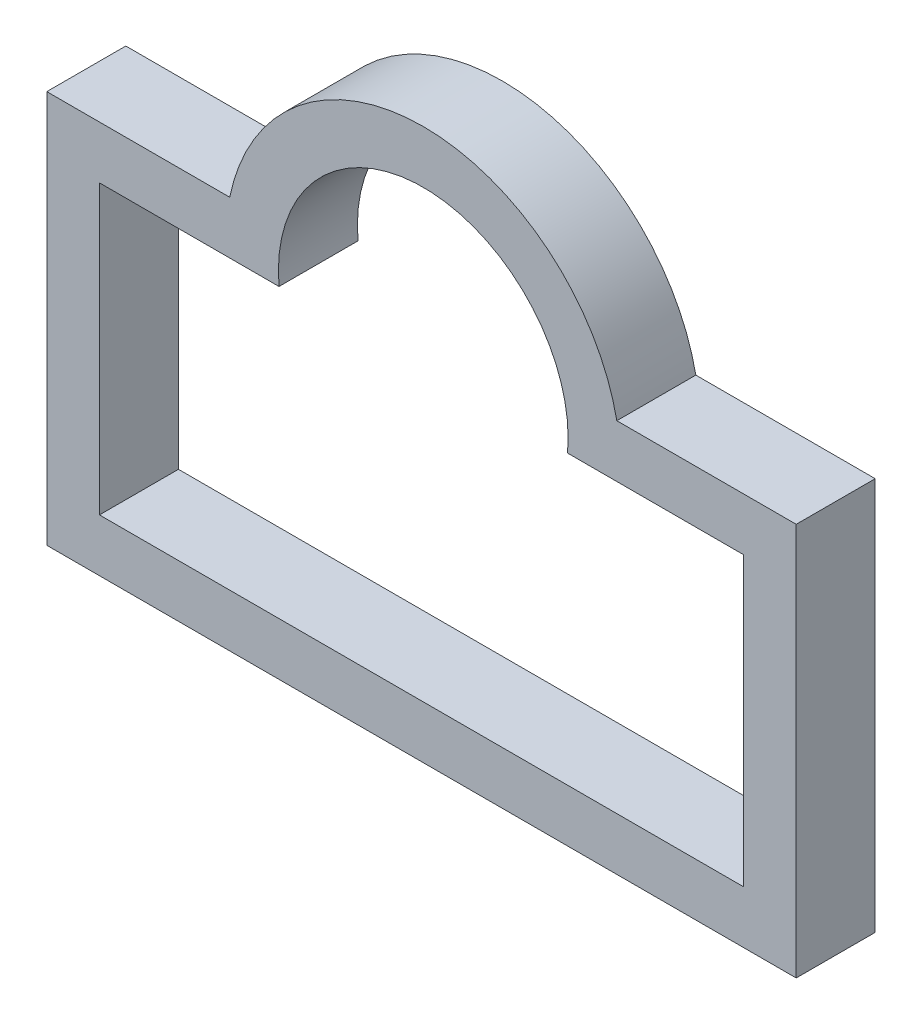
ISO-10303-21;
HEADER;
FILE_DESCRIPTION(('STEP AP214'),'2;1');
FILE_NAME('part.step','',(''),(''),'','','');
FILE_SCHEMA(('AUTOMOTIVE_DESIGN { 1 0 10303 214 1 1 1 1 }'));
ENDSEC;
DATA;
#1=APPLICATION_CONTEXT('core data for automotive mechanical design processes');
#2=APPLICATION_PROTOCOL_DEFINITION('international standard','automotive_design',2000,#1);
#3=PRODUCT_CONTEXT('',#1,'mechanical');
#4=PRODUCT('Part','Part','',(#3));
#5=PRODUCT_RELATED_PRODUCT_CATEGORY('part','',(#4));
#6=PRODUCT_DEFINITION_FORMATION('','',#4);
#7=PRODUCT_DEFINITION_CONTEXT('part definition',#1,'design');
#8=PRODUCT_DEFINITION('design','',#6,#7);
#9=PRODUCT_DEFINITION_SHAPE('','',#8);
#10=(LENGTH_UNIT() NAMED_UNIT(*) SI_UNIT(.MILLI.,.METRE.));
#11=(NAMED_UNIT(*) PLANE_ANGLE_UNIT() SI_UNIT($,.RADIAN.));
#12=(NAMED_UNIT(*) SI_UNIT($,.STERADIAN.) SOLID_ANGLE_UNIT());
#13=UNCERTAINTY_MEASURE_WITH_UNIT(LENGTH_MEASURE(1.E-05),#10,'distance_accuracy_value','');
#14=(GEOMETRIC_REPRESENTATION_CONTEXT(3) GLOBAL_UNCERTAINTY_ASSIGNED_CONTEXT((#13)) GLOBAL_UNIT_ASSIGNED_CONTEXT((#10,
#11,#12)) REPRESENTATION_CONTEXT('',''));
#15=CARTESIAN_POINT('',(0.,0.,0.));
#16=DIRECTION('',(0.,0.,1.));
#17=DIRECTION('',(1.,0.,0.));
#18=AXIS2_PLACEMENT_3D('',#15,#16,#17);
#19=CARTESIAN_POINT('',(0.,0.,15.24));
#20=DIRECTION('',(0.,0.,1.));
#21=DIRECTION('',(1.,0.,0.));
#22=AXIS2_PLACEMENT_3D('',#19,#20,#21);
#23=PLANE('',#22);
#24=CARTESIAN_POINT('',(0.,0.,15.24));
#25=DIRECTION('',(0.,0.,1.));
#26=DIRECTION('',(1.,0.,0.));
#27=AXIS2_PLACEMENT_3D('',#24,#25,#26);
#28=CIRCLE('',#27,38.1067483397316);
#29=CARTESIAN_POINT('',(37.3371111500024,7.62,15.24));
#30=VERTEX_POINT('',#29);
#31=CARTESIAN_POINT('',(-37.3371111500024,7.62,15.24));
#32=VERTEX_POINT('',#31);
#33=EDGE_CURVE('E219',#30,#32,#28,.T.);
#34=ORIENTED_EDGE('',*,*,#33,.T.);
#35=DIRECTION('',(1.,0.,0.));
#36=VECTOR('',#35,1.);
#37=CARTESIAN_POINT('',(-0.330874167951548,7.62,15.24));
#38=LINE('',#37,#36);
#39=CARTESIAN_POINT('',(-72.6261514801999,7.62,15.24));
#40=VERTEX_POINT('',#39);
#41=EDGE_CURVE('E221',#40,#32,#38,.T.);
#42=ORIENTED_EDGE('',*,*,#41,.F.);
#43=DIRECTION('',(0.,-1.,0.));
#44=VECTOR('',#43,1.);
#45=CARTESIAN_POINT('',(-72.6261514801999,-142.050207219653,15.24));
#46=LINE('',#45,#44);
#47=CARTESIAN_POINT('',(-72.6261514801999,-68.1783621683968,15.24));
#48=VERTEX_POINT('',#47);
#49=EDGE_CURVE('E224',#40,#48,#46,.T.);
#50=ORIENTED_EDGE('',*,*,#49,.T.);
#51=DIRECTION('',(1.,0.,0.));
#52=VECTOR('',#51,1.);
#53=CARTESIAN_POINT('',(-0.330874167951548,-68.1783621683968,15.24));
#54=LINE('',#53,#52);
#55=CARTESIAN_POINT('',(71.941876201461,-68.1783621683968,15.24));
#56=VERTEX_POINT('',#55);
#57=EDGE_CURVE('E226',#48,#56,#54,.T.);
#58=ORIENTED_EDGE('',*,*,#57,.T.);
#59=DIRECTION('',(0.,-1.,0.));
#60=VECTOR('',#59,1.);
#61=CARTESIAN_POINT('',(71.941876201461,-142.050207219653,15.24));
#62=LINE('',#61,#60);
#63=CARTESIAN_POINT('',(71.941876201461,7.62,15.24));
#64=VERTEX_POINT('',#63);
#65=EDGE_CURVE('E228',#64,#56,#62,.T.);
#66=ORIENTED_EDGE('',*,*,#65,.F.);
#67=DIRECTION('',(1.,0.,0.));
#68=VECTOR('',#67,1.);
#69=CARTESIAN_POINT('',(-0.330874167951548,7.62,15.24));
#70=LINE('',#69,#68);
#71=EDGE_CURVE('E231',#30,#64,#70,.T.);
#72=ORIENTED_EDGE('',*,*,#71,.F.);
#73=EDGE_LOOP('',(#34,#42,#50,#58,#66,#72));
#74=FACE_BOUND('',#73,.T.);
#75=DIRECTION('',(1.,0.,0.));
#76=VECTOR('',#75,1.);
#77=CARTESIAN_POINT('',(-0.330874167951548,-2.54,15.24));
#78=LINE('',#77,#76);
#79=CARTESIAN_POINT('',(-62.4661514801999,-2.54,15.24));
#80=VERTEX_POINT('',#79);
#81=CARTESIAN_POINT('',(-27.8310823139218,-2.54,15.24));
#82=VERTEX_POINT('',#81);
#83=EDGE_CURVE('E184',#80,#82,#78,.T.);
#84=ORIENTED_EDGE('',*,*,#83,.T.);
#85=CARTESIAN_POINT('',(0.,0.,15.24));
#86=DIRECTION('',(0.,0.,1.));
#87=DIRECTION('',(1.,0.,0.));
#88=AXIS2_PLACEMENT_3D('',#85,#86,#87);
#89=CIRCLE('',#88,27.9467483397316);
#90=CARTESIAN_POINT('',(27.8310823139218,-2.54,15.24));
#91=VERTEX_POINT('',#90);
#92=EDGE_CURVE('E153',#91,#82,#89,.T.);
#93=ORIENTED_EDGE('',*,*,#92,.F.);
#94=DIRECTION('',(1.,0.,0.));
#95=VECTOR('',#94,1.);
#96=CARTESIAN_POINT('',(-0.330874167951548,-2.54,15.24));
#97=LINE('',#96,#95);
#98=CARTESIAN_POINT('',(61.781876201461,-2.54,15.24));
#99=VERTEX_POINT('',#98);
#100=EDGE_CURVE('E191',#91,#99,#97,.T.);
#101=ORIENTED_EDGE('',*,*,#100,.T.);
#102=DIRECTION('',(0.,-1.,0.));
#103=VECTOR('',#102,1.);
#104=CARTESIAN_POINT('',(61.781876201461,-142.050207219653,15.24));
#105=LINE('',#104,#103);
#106=CARTESIAN_POINT('',(61.781876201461,-58.0183621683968,15.24));
#107=VERTEX_POINT('',#106);
#108=EDGE_CURVE('E77',#99,#107,#105,.T.);
#109=ORIENTED_EDGE('',*,*,#108,.T.);
#110=DIRECTION('',(1.,0.,0.));
#111=VECTOR('',#110,1.);
#112=CARTESIAN_POINT('',(-0.330874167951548,-58.0183621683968,15.24));
#113=LINE('',#112,#111);
#114=CARTESIAN_POINT('',(-62.4661514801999,-58.0183621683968,15.24));
#115=VERTEX_POINT('',#114);
#116=EDGE_CURVE('E188',#115,#107,#113,.T.);
#117=ORIENTED_EDGE('',*,*,#116,.F.);
#118=DIRECTION('',(0.,-1.,0.));
#119=VECTOR('',#118,1.);
#120=CARTESIAN_POINT('',(-62.4661514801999,-142.050207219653,15.24));
#121=LINE('',#120,#119);
#122=EDGE_CURVE('E186',#80,#115,#121,.T.);
#123=ORIENTED_EDGE('',*,*,#122,.F.);
#124=EDGE_LOOP('',(#84,#93,#101,#109,#117,#123));
#125=FACE_BOUND('',#124,.T.);
#126=ADVANCED_FACE('F62',(#74,#125),#23,.T.);
#127=CARTESIAN_POINT('',(0.,0.,0.));
#128=DIRECTION('',(0.,0.,1.));
#129=DIRECTION('',(1.,0.,0.));
#130=AXIS2_PLACEMENT_3D('',#127,#128,#129);
#131=PLANE('',#130);
#132=CARTESIAN_POINT('',(0.,0.,0.));
#133=DIRECTION('',(0.,0.,1.));
#134=DIRECTION('',(1.,0.,0.));
#135=AXIS2_PLACEMENT_3D('',#132,#133,#134);
#136=CIRCLE('',#135,38.1067483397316);
#137=CARTESIAN_POINT('',(37.3371111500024,7.62,0.));
#138=VERTEX_POINT('',#137);
#139=CARTESIAN_POINT('',(-37.3371111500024,7.62,0.));
#140=VERTEX_POINT('',#139);
#141=EDGE_CURVE('E157',#138,#140,#136,.T.);
#142=ORIENTED_EDGE('',*,*,#141,.F.);
#143=DIRECTION('',(1.,0.,0.));
#144=VECTOR('',#143,1.);
#145=CARTESIAN_POINT('',(-0.330874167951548,7.62,0.));
#146=LINE('',#145,#144);
#147=CARTESIAN_POINT('',(71.941876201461,7.62,0.));
#148=VERTEX_POINT('',#147);
#149=EDGE_CURVE('E216',#138,#148,#146,.T.);
#150=ORIENTED_EDGE('',*,*,#149,.T.);
#151=DIRECTION('',(0.,-1.,0.));
#152=VECTOR('',#151,1.);
#153=CARTESIAN_POINT('',(71.941876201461,-142.050207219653,0.));
#154=LINE('',#153,#152);
#155=CARTESIAN_POINT('',(71.941876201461,-68.1783621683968,0.));
#156=VERTEX_POINT('',#155);
#157=EDGE_CURVE('E213',#148,#156,#154,.T.);
#158=ORIENTED_EDGE('',*,*,#157,.T.);
#159=DIRECTION('',(1.,0.,0.));
#160=VECTOR('',#159,1.);
#161=CARTESIAN_POINT('',(-0.330874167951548,-68.1783621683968,0.));
#162=LINE('',#161,#160);
#163=CARTESIAN_POINT('',(-72.6261514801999,-68.1783621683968,0.));
#164=VERTEX_POINT('',#163);
#165=EDGE_CURVE('E210',#164,#156,#162,.T.);
#166=ORIENTED_EDGE('',*,*,#165,.F.);
#167=DIRECTION('',(0.,-1.,0.));
#168=VECTOR('',#167,1.);
#169=CARTESIAN_POINT('',(-72.6261514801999,-142.050207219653,0.));
#170=LINE('',#169,#168);
#171=CARTESIAN_POINT('',(-72.6261514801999,7.62,0.));
#172=VERTEX_POINT('',#171);
#173=EDGE_CURVE('E208',#172,#164,#170,.T.);
#174=ORIENTED_EDGE('',*,*,#173,.F.);
#175=DIRECTION('',(1.,0.,0.));
#176=VECTOR('',#175,1.);
#177=CARTESIAN_POINT('',(-0.330874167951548,7.62,0.));
#178=LINE('',#177,#176);
#179=EDGE_CURVE('E205',#172,#140,#178,.T.);
#180=ORIENTED_EDGE('',*,*,#179,.T.);
#181=EDGE_LOOP('',(#142,#150,#158,#166,#174,#180));
#182=FACE_BOUND('',#181,.T.);
#183=CARTESIAN_POINT('',(0.,0.,0.));
#184=DIRECTION('',(0.,0.,1.));
#185=DIRECTION('',(1.,0.,0.));
#186=AXIS2_PLACEMENT_3D('',#183,#184,#185);
#187=CIRCLE('',#186,27.9467483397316);
#188=CARTESIAN_POINT('',(27.8310823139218,-2.54,0.));
#189=VERTEX_POINT('',#188);
#190=CARTESIAN_POINT('',(-27.8310823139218,-2.54,0.));
#191=VERTEX_POINT('',#190);
#192=EDGE_CURVE('E85',#189,#191,#187,.T.);
#193=ORIENTED_EDGE('',*,*,#192,.T.);
#194=DIRECTION('',(1.,0.,0.));
#195=VECTOR('',#194,1.);
#196=CARTESIAN_POINT('',(-0.330874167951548,-2.54,0.));
#197=LINE('',#196,#195);
#198=CARTESIAN_POINT('',(-62.4661514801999,-2.54,0.));
#199=VERTEX_POINT('',#198);
#200=EDGE_CURVE('E161',#199,#191,#197,.T.);
#201=ORIENTED_EDGE('',*,*,#200,.F.);
#202=DIRECTION('',(0.,-1.,0.));
#203=VECTOR('',#202,1.);
#204=CARTESIAN_POINT('',(-62.4661514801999,-142.050207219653,0.));
#205=LINE('',#204,#203);
#206=CARTESIAN_POINT('',(-62.4661514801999,-58.0183621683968,0.));
#207=VERTEX_POINT('',#206);
#208=EDGE_CURVE('E166',#199,#207,#205,.T.);
#209=ORIENTED_EDGE('',*,*,#208,.T.);
#210=DIRECTION('',(1.,0.,0.));
#211=VECTOR('',#210,1.);
#212=CARTESIAN_POINT('',(-0.330874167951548,-58.0183621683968,0.));
#213=LINE('',#212,#211);
#214=CARTESIAN_POINT('',(61.781876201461,-58.0183621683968,0.));
#215=VERTEX_POINT('',#214);
#216=EDGE_CURVE('E176',#207,#215,#213,.T.);
#217=ORIENTED_EDGE('',*,*,#216,.T.);
#218=DIRECTION('',(0.,-1.,0.));
#219=VECTOR('',#218,1.);
#220=CARTESIAN_POINT('',(61.781876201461,-142.050207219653,0.));
#221=LINE('',#220,#219);
#222=CARTESIAN_POINT('',(61.781876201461,-2.54,0.));
#223=VERTEX_POINT('',#222);
#224=EDGE_CURVE('E179',#223,#215,#221,.T.);
#225=ORIENTED_EDGE('',*,*,#224,.F.);
#226=DIRECTION('',(1.,0.,0.));
#227=VECTOR('',#226,1.);
#228=CARTESIAN_POINT('',(-0.330874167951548,-2.54,0.));
#229=LINE('',#228,#227);
#230=EDGE_CURVE('E172',#189,#223,#229,.T.);
#231=ORIENTED_EDGE('',*,*,#230,.F.);
#232=EDGE_LOOP('',(#193,#201,#209,#217,#225,#231));
#233=FACE_BOUND('',#232,.T.);
#234=ADVANCED_FACE('F169',(#182,#233),#131,.F.);
#235=CARTESIAN_POINT('',(0.,0.,15.24));
#236=DIRECTION('',(0.,0.,-1.));
#237=DIRECTION('',(-1.,0.,0.));
#238=AXIS2_PLACEMENT_3D('',#235,#236,#237);
#239=CYLINDRICAL_SURFACE('',#238,38.1067483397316);
#240=ORIENTED_EDGE('',*,*,#141,.T.);
#241=DIRECTION('',(0.,0.,-1.));
#242=VECTOR('',#241,1.);
#243=CARTESIAN_POINT('',(-37.3371111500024,7.62,15.24));
#244=LINE('',#243,#242);
#245=EDGE_CURVE('E12',#32,#140,#244,.T.);
#246=ORIENTED_EDGE('',*,*,#245,.F.);
#247=ORIENTED_EDGE('',*,*,#33,.F.);
#248=DIRECTION('',(0.,0.,-1.));
#249=VECTOR('',#248,1.);
#250=CARTESIAN_POINT('',(37.3371111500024,7.62,15.24));
#251=LINE('',#250,#249);
#252=EDGE_CURVE('E234',#30,#138,#251,.T.);
#253=ORIENTED_EDGE('',*,*,#252,.T.);
#254=EDGE_LOOP('',(#240,#246,#247,#253));
#255=FACE_BOUND('',#254,.T.);
#256=ADVANCED_FACE('F64',(#255),#239,.T.);
#257=CARTESIAN_POINT('',(-0.330874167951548,7.62,15.24));
#258=DIRECTION('',(0.,1.,0.));
#259=DIRECTION('',(0.,0.,1.));
#260=AXIS2_PLACEMENT_3D('',#257,#258,#259);
#261=PLANE('',#260);
#262=ORIENTED_EDGE('',*,*,#179,.F.);
#263=DIRECTION('',(0.,0.,-1.));
#264=VECTOR('',#263,1.);
#265=CARTESIAN_POINT('',(-72.6261514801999,7.62,15.24));
#266=LINE('',#265,#264);
#267=EDGE_CURVE('E70',#40,#172,#266,.T.);
#268=ORIENTED_EDGE('',*,*,#267,.F.);
#269=ORIENTED_EDGE('',*,*,#41,.T.);
#270=ORIENTED_EDGE('',*,*,#245,.T.);
#271=EDGE_LOOP('',(#262,#268,#269,#270));
#272=FACE_BOUND('',#271,.T.);
#273=ADVANCED_FACE('F253',(#272),#261,.T.);
#274=CARTESIAN_POINT('',(-72.6261514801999,-142.050207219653,15.24));
#275=DIRECTION('',(1.,0.,0.));
#276=DIRECTION('',(0.,0.,-1.));
#277=AXIS2_PLACEMENT_3D('',#274,#275,#276);
#278=PLANE('',#277);
#279=ORIENTED_EDGE('',*,*,#173,.T.);
#280=DIRECTION('',(0.,0.,-1.));
#281=VECTOR('',#280,1.);
#282=CARTESIAN_POINT('',(-72.6261514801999,-68.1783621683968,15.24));
#283=LINE('',#282,#281);
#284=EDGE_CURVE('E240',#48,#164,#283,.T.);
#285=ORIENTED_EDGE('',*,*,#284,.F.);
#286=ORIENTED_EDGE('',*,*,#49,.F.);
#287=ORIENTED_EDGE('',*,*,#267,.T.);
#288=EDGE_LOOP('',(#279,#285,#286,#287));
#289=FACE_BOUND('',#288,.T.);
#290=ADVANCED_FACE('F245',(#289),#278,.F.);
#291=CARTESIAN_POINT('',(-0.330874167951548,-68.1783621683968,15.24));
#292=DIRECTION('',(0.,1.,0.));
#293=DIRECTION('',(0.,0.,1.));
#294=AXIS2_PLACEMENT_3D('',#291,#292,#293);
#295=PLANE('',#294);
#296=ORIENTED_EDGE('',*,*,#165,.T.);
#297=DIRECTION('',(0.,0.,-1.));
#298=VECTOR('',#297,1.);
#299=CARTESIAN_POINT('',(71.941876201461,-68.1783621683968,15.24));
#300=LINE('',#299,#298);
#301=EDGE_CURVE('E238',#56,#156,#300,.T.);
#302=ORIENTED_EDGE('',*,*,#301,.F.);
#303=ORIENTED_EDGE('',*,*,#57,.F.);
#304=ORIENTED_EDGE('',*,*,#284,.T.);
#305=EDGE_LOOP('',(#296,#302,#303,#304));
#306=FACE_BOUND('',#305,.T.);
#307=ADVANCED_FACE('F268',(#306),#295,.F.);
#308=CARTESIAN_POINT('',(71.941876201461,-142.050207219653,15.24));
#309=DIRECTION('',(1.,0.,0.));
#310=DIRECTION('',(0.,0.,-1.));
#311=AXIS2_PLACEMENT_3D('',#308,#309,#310);
#312=PLANE('',#311);
#313=ORIENTED_EDGE('',*,*,#157,.F.);
#314=DIRECTION('',(0.,0.,-1.));
#315=VECTOR('',#314,1.);
#316=CARTESIAN_POINT('',(71.941876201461,7.62,15.24));
#317=LINE('',#316,#315);
#318=EDGE_CURVE('E236',#64,#148,#317,.T.);
#319=ORIENTED_EDGE('',*,*,#318,.F.);
#320=ORIENTED_EDGE('',*,*,#65,.T.);
#321=ORIENTED_EDGE('',*,*,#301,.T.);
#322=EDGE_LOOP('',(#313,#319,#320,#321));
#323=FACE_BOUND('',#322,.T.);
#324=ADVANCED_FACE('F264',(#323),#312,.T.);
#325=CARTESIAN_POINT('',(-0.330874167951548,7.62,15.24));
#326=DIRECTION('',(0.,1.,0.));
#327=DIRECTION('',(0.,0.,1.));
#328=AXIS2_PLACEMENT_3D('',#325,#326,#327);
#329=PLANE('',#328);
#330=ORIENTED_EDGE('',*,*,#149,.F.);
#331=ORIENTED_EDGE('',*,*,#252,.F.);
#332=ORIENTED_EDGE('',*,*,#71,.T.);
#333=ORIENTED_EDGE('',*,*,#318,.T.);
#334=EDGE_LOOP('',(#330,#331,#332,#333));
#335=FACE_BOUND('',#334,.T.);
#336=ADVANCED_FACE('F259',(#335),#329,.T.);
#337=CARTESIAN_POINT('',(0.,0.,15.24));
#338=DIRECTION('',(0.,0.,-1.));
#339=DIRECTION('',(-1.,0.,0.));
#340=AXIS2_PLACEMENT_3D('',#337,#338,#339);
#341=CYLINDRICAL_SURFACE('',#340,27.9467483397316);
#342=ORIENTED_EDGE('',*,*,#192,.F.);
#343=DIRECTION('',(0.,0.,-1.));
#344=VECTOR('',#343,1.);
#345=CARTESIAN_POINT('',(27.8310823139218,-2.54,15.24));
#346=LINE('',#345,#344);
#347=EDGE_CURVE('E194',#91,#189,#346,.T.);
#348=ORIENTED_EDGE('',*,*,#347,.F.);
#349=ORIENTED_EDGE('',*,*,#92,.T.);
#350=DIRECTION('',(0.,0.,-1.));
#351=VECTOR('',#350,1.);
#352=CARTESIAN_POINT('',(-27.8310823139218,-2.54,15.24));
#353=LINE('',#352,#351);
#354=EDGE_CURVE('E149',#82,#191,#353,.T.);
#355=ORIENTED_EDGE('',*,*,#354,.T.);
#356=EDGE_LOOP('',(#342,#348,#349,#355));
#357=FACE_BOUND('',#356,.T.);
#358=ADVANCED_FACE('F151',(#357),#341,.F.);
#359=CARTESIAN_POINT('',(-0.330874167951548,-2.54,15.24));
#360=DIRECTION('',(0.,1.,0.));
#361=DIRECTION('',(0.,0.,1.));
#362=AXIS2_PLACEMENT_3D('',#359,#360,#361);
#363=PLANE('',#362);
#364=ORIENTED_EDGE('',*,*,#200,.T.);
#365=ORIENTED_EDGE('',*,*,#354,.F.);
#366=ORIENTED_EDGE('',*,*,#83,.F.);
#367=DIRECTION('',(0.,0.,-1.));
#368=VECTOR('',#367,1.);
#369=CARTESIAN_POINT('',(-62.4661514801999,-2.54,15.24));
#370=LINE('',#369,#368);
#371=EDGE_CURVE('E158',#80,#199,#370,.T.);
#372=ORIENTED_EDGE('',*,*,#371,.T.);
#373=EDGE_LOOP('',(#364,#365,#366,#372));
#374=FACE_BOUND('',#373,.T.);
#375=ADVANCED_FACE('F162',(#374),#363,.F.);
#376=CARTESIAN_POINT('',(-62.4661514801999,-142.050207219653,15.24));
#377=DIRECTION('',(1.,0.,0.));
#378=DIRECTION('',(0.,0.,-1.));
#379=AXIS2_PLACEMENT_3D('',#376,#377,#378);
#380=PLANE('',#379);
#381=ORIENTED_EDGE('',*,*,#208,.F.);
#382=ORIENTED_EDGE('',*,*,#371,.F.);
#383=ORIENTED_EDGE('',*,*,#122,.T.);
#384=DIRECTION('',(0.,0.,-1.));
#385=VECTOR('',#384,1.);
#386=CARTESIAN_POINT('',(-62.4661514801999,-58.0183621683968,15.24));
#387=LINE('',#386,#385);
#388=EDGE_CURVE('E200',#115,#207,#387,.T.);
#389=ORIENTED_EDGE('',*,*,#388,.T.);
#390=EDGE_LOOP('',(#381,#382,#383,#389));
#391=FACE_BOUND('',#390,.T.);
#392=ADVANCED_FACE('F277',(#391),#380,.T.);
#393=CARTESIAN_POINT('',(-0.330874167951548,-58.0183621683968,15.24));
#394=DIRECTION('',(0.,1.,0.));
#395=DIRECTION('',(0.,0.,1.));
#396=AXIS2_PLACEMENT_3D('',#393,#394,#395);
#397=PLANE('',#396);
#398=ORIENTED_EDGE('',*,*,#216,.F.);
#399=ORIENTED_EDGE('',*,*,#388,.F.);
#400=ORIENTED_EDGE('',*,*,#116,.T.);
#401=DIRECTION('',(0.,0.,-1.));
#402=VECTOR('',#401,1.);
#403=CARTESIAN_POINT('',(61.781876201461,-58.0183621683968,15.24));
#404=LINE('',#403,#402);
#405=EDGE_CURVE('E198',#107,#215,#404,.T.);
#406=ORIENTED_EDGE('',*,*,#405,.T.);
#407=EDGE_LOOP('',(#398,#399,#400,#406));
#408=FACE_BOUND('',#407,.T.);
#409=ADVANCED_FACE('F280',(#408),#397,.T.);
#410=CARTESIAN_POINT('',(61.781876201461,-142.050207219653,15.24));
#411=DIRECTION('',(1.,0.,0.));
#412=DIRECTION('',(0.,0.,-1.));
#413=AXIS2_PLACEMENT_3D('',#410,#411,#412);
#414=PLANE('',#413);
#415=ORIENTED_EDGE('',*,*,#224,.T.);
#416=ORIENTED_EDGE('',*,*,#405,.F.);
#417=ORIENTED_EDGE('',*,*,#108,.F.);
#418=DIRECTION('',(0.,0.,-1.));
#419=VECTOR('',#418,1.);
#420=CARTESIAN_POINT('',(61.781876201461,-2.54,15.24));
#421=LINE('',#420,#419);
#422=EDGE_CURVE('E196',#99,#223,#421,.T.);
#423=ORIENTED_EDGE('',*,*,#422,.T.);
#424=EDGE_LOOP('',(#415,#416,#417,#423));
#425=FACE_BOUND('',#424,.T.);
#426=ADVANCED_FACE('F281',(#425),#414,.F.);
#427=CARTESIAN_POINT('',(-0.330874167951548,-2.54,15.24));
#428=DIRECTION('',(0.,1.,0.));
#429=DIRECTION('',(0.,0.,1.));
#430=AXIS2_PLACEMENT_3D('',#427,#428,#429);
#431=PLANE('',#430);
#432=ORIENTED_EDGE('',*,*,#230,.T.);
#433=ORIENTED_EDGE('',*,*,#422,.F.);
#434=ORIENTED_EDGE('',*,*,#100,.F.);
#435=ORIENTED_EDGE('',*,*,#347,.T.);
#436=EDGE_LOOP('',(#432,#433,#434,#435));
#437=FACE_BOUND('',#436,.T.);
#438=ADVANCED_FACE('F284',(#437),#431,.F.);
#439=CLOSED_SHELL('',(#126,#234,#256,#273,#290,#307,#324,#336,#358,#375,#392,#409,#426,#438));
#440=MANIFOLD_SOLID_BREP('B2',#439);
#441=ADVANCED_BREP_SHAPE_REPRESENTATION('',(#18,#440),#14);
#442=SHAPE_DEFINITION_REPRESENTATION(#9,#441);
ENDSEC;
END-ISO-10303-21;
